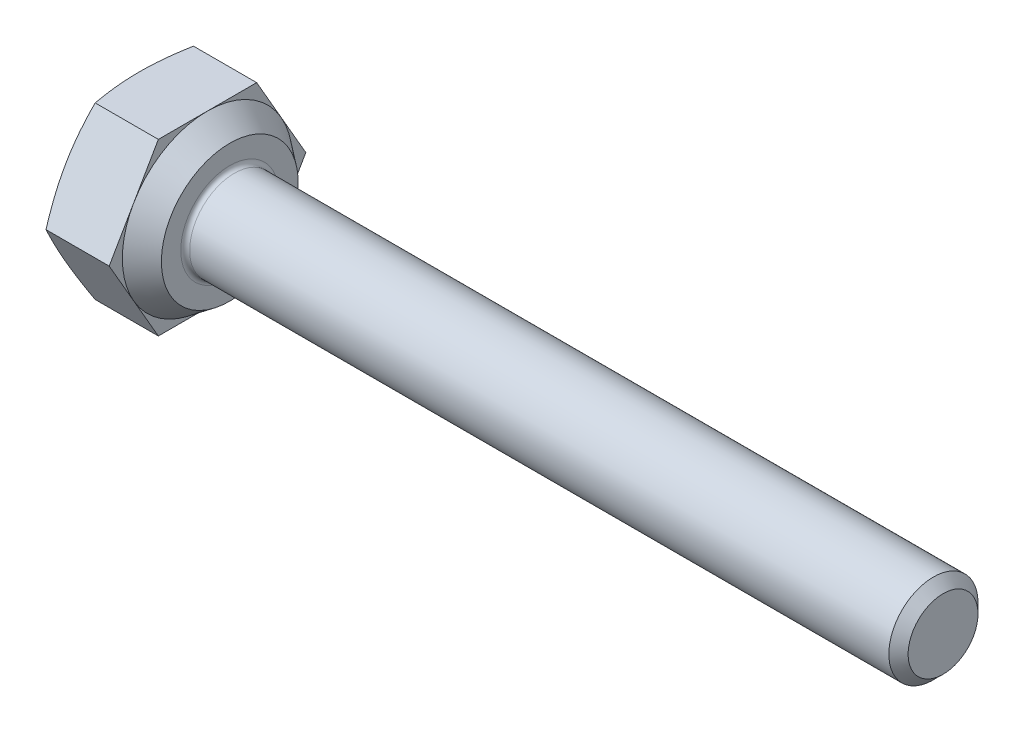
ISO-10303-21;
HEADER;
FILE_DESCRIPTION(('STEP AP214'),'2;1');
FILE_NAME('part.step','',(''),(''),'','','');
FILE_SCHEMA(('AUTOMOTIVE_DESIGN { 1 0 10303 214 1 1 1 1 }'));
ENDSEC;
DATA;
#1=APPLICATION_CONTEXT('core data for automotive mechanical design processes');
#2=APPLICATION_PROTOCOL_DEFINITION('international standard','automotive_design',2000,#1);
#3=PRODUCT_CONTEXT('',#1,'mechanical');
#4=PRODUCT('Part','Part','',(#3));
#5=PRODUCT_RELATED_PRODUCT_CATEGORY('part','',(#4));
#6=PRODUCT_DEFINITION_FORMATION('','',#4);
#7=PRODUCT_DEFINITION_CONTEXT('part definition',#1,'design');
#8=PRODUCT_DEFINITION('design','',#6,#7);
#9=PRODUCT_DEFINITION_SHAPE('','',#8);
#10=(LENGTH_UNIT() NAMED_UNIT(*) SI_UNIT(.MILLI.,.METRE.));
#11=(NAMED_UNIT(*) PLANE_ANGLE_UNIT() SI_UNIT($,.RADIAN.));
#12=(NAMED_UNIT(*) SI_UNIT($,.STERADIAN.) SOLID_ANGLE_UNIT());
#13=UNCERTAINTY_MEASURE_WITH_UNIT(LENGTH_MEASURE(1.E-05),#10,'distance_accuracy_value','');
#14=(GEOMETRIC_REPRESENTATION_CONTEXT(3) GLOBAL_UNCERTAINTY_ASSIGNED_CONTEXT((#13)) GLOBAL_UNIT_ASSIGNED_CONTEXT((#10,
#11,#12)) REPRESENTATION_CONTEXT('',''));
#15=CARTESIAN_POINT('',(0.,0.,0.));
#16=DIRECTION('',(0.,0.,1.));
#17=DIRECTION('',(1.,0.,0.));
#18=AXIS2_PLACEMENT_3D('',#15,#16,#17);
#19=CARTESIAN_POINT('',(2.025,0.,0.));
#20=DIRECTION('',(1.,0.,0.));
#21=DIRECTION('',(0.,0.,-1.));
#22=AXIS2_PLACEMENT_3D('',#19,#20,#21);
#23=PLANE('',#22);
#24=CARTESIAN_POINT('',(2.025,0.,0.));
#25=DIRECTION('',(1.,0.,0.));
#26=DIRECTION('',(0.,0.,-1.));
#27=AXIS2_PLACEMENT_3D('',#24,#25,#26);
#28=CIRCLE('',#27,1.1);
#29=CARTESIAN_POINT('',(2.025,0.,-1.1));
#30=VERTEX_POINT('',#29);
#31=EDGE_CURVE('E188',#30,#30,#28,.F.);
#32=ORIENTED_EDGE('',*,*,#31,.T.);
#33=EDGE_LOOP('',(#32));
#34=FACE_BOUND('',#33,.T.);
#35=CARTESIAN_POINT('',(2.025,0.,0.));
#36=DIRECTION('',(-1.,0.,0.));
#37=DIRECTION('',(0.,0.,1.));
#38=AXIS2_PLACEMENT_3D('',#35,#36,#37);
#39=CIRCLE('',#38,1.535);
#40=CARTESIAN_POINT('',(2.025,0.,1.535));
#41=VERTEX_POINT('',#40);
#42=EDGE_CURVE('E138',#41,#41,#39,.T.);
#43=ORIENTED_EDGE('',*,*,#42,.F.);
#44=EDGE_LOOP('',(#43));
#45=FACE_BOUND('',#44,.T.);
#46=ADVANCED_FACE('F33',(#34,#45),#23,.T.);
#47=CARTESIAN_POINT('',(1.525,-3.82,0.));
#48=DIRECTION('',(-1.,0.,0.));
#49=DIRECTION('',(0.,0.,1.));
#50=AXIS2_PLACEMENT_3D('',#47,#48,#49);
#51=PLANE('',#50);
#52=DIRECTION('',(0.,-0.866025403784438,0.5));
#53=VECTOR('',#52,1.);
#54=CARTESIAN_POINT('',(1.525,1.91,1.10273901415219));
#55=LINE('',#54,#53);
#56=CARTESIAN_POINT('',(1.525,1.91,1.10273901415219));
#57=VERTEX_POINT('',#56);
#58=CARTESIAN_POINT('',(1.525,0.955000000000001,1.65410852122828));
#59=VERTEX_POINT('',#58);
#60=EDGE_CURVE('E137',#57,#59,#55,.T.);
#61=ORIENTED_EDGE('',*,*,#60,.T.);
#62=CARTESIAN_POINT('',(1.525,0.,0.));
#63=DIRECTION('',(-1.,0.,0.));
#64=DIRECTION('',(0.,0.,1.));
#65=AXIS2_PLACEMENT_3D('',#62,#63,#64);
#66=CIRCLE('',#65,1.91);
#67=CARTESIAN_POINT('',(1.525,1.91,0.));
#68=VERTEX_POINT('',#67);
#69=EDGE_CURVE('E49',#59,#68,#66,.T.);
#70=ORIENTED_EDGE('',*,*,#69,.T.);
#71=DIRECTION('',(0.,0.,1.));
#72=VECTOR('',#71,1.);
#73=CARTESIAN_POINT('',(1.525,1.91,-1.10273901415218));
#74=LINE('',#73,#72);
#75=EDGE_CURVE('E134',#68,#57,#74,.T.);
#76=ORIENTED_EDGE('',*,*,#75,.T.);
#77=EDGE_LOOP('',(#61,#70,#76));
#78=FACE_BOUND('',#77,.T.);
#79=ADVANCED_FACE('F133',(#78),#51,.F.);
#80=CARTESIAN_POINT('',(1.525,1.91,-1.10273901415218));
#81=VERTEX_POINT('',#80);
#82=EDGE_CURVE('E145',#81,#68,#74,.T.);
#83=ORIENTED_EDGE('',*,*,#82,.T.);
#84=CARTESIAN_POINT('',(1.525,0.955,-1.65410852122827));
#85=VERTEX_POINT('',#84);
#86=EDGE_CURVE('E121',#68,#85,#66,.T.);
#87=ORIENTED_EDGE('',*,*,#86,.T.);
#88=DIRECTION('',(0.,0.866025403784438,0.5));
#89=VECTOR('',#88,1.);
#90=CARTESIAN_POINT('',(1.525,0.,-2.20547802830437));
#91=LINE('',#90,#89);
#92=EDGE_CURVE('E151',#85,#81,#91,.T.);
#93=ORIENTED_EDGE('',*,*,#92,.T.);
#94=EDGE_LOOP('',(#83,#87,#93));
#95=FACE_BOUND('',#94,.T.);
#96=ADVANCED_FACE('F150',(#95),#51,.F.);
#97=CARTESIAN_POINT('',(1.525,0.,-2.20547802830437));
#98=VERTEX_POINT('',#97);
#99=EDGE_CURVE('E148',#98,#85,#91,.T.);
#100=ORIENTED_EDGE('',*,*,#99,.T.);
#101=CARTESIAN_POINT('',(1.525,-0.954999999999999,-1.65410852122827));
#102=VERTEX_POINT('',#101);
#103=EDGE_CURVE('E124',#85,#102,#66,.T.);
#104=ORIENTED_EDGE('',*,*,#103,.T.);
#105=DIRECTION('',(0.,0.866025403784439,-0.5));
#106=VECTOR('',#105,1.);
#107=CARTESIAN_POINT('',(1.525,-1.91,-1.10273901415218));
#108=LINE('',#107,#106);
#109=EDGE_CURVE('E348',#102,#98,#108,.T.);
#110=ORIENTED_EDGE('',*,*,#109,.T.);
#111=EDGE_LOOP('',(#100,#104,#110));
#112=FACE_BOUND('',#111,.T.);
#113=ADVANCED_FACE('F302',(#112),#51,.F.);
#114=CARTESIAN_POINT('',(1.525,-1.91,-1.10273901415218));
#115=VERTEX_POINT('',#114);
#116=EDGE_CURVE('E316',#115,#102,#108,.T.);
#117=ORIENTED_EDGE('',*,*,#116,.T.);
#118=CARTESIAN_POINT('',(1.525,-1.91,0.));
#119=VERTEX_POINT('',#118);
#120=EDGE_CURVE('E317',#102,#119,#66,.T.);
#121=ORIENTED_EDGE('',*,*,#120,.T.);
#122=DIRECTION('',(0.,0.,-1.));
#123=VECTOR('',#122,1.);
#124=CARTESIAN_POINT('',(1.525,-1.91,1.10273901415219));
#125=LINE('',#124,#123);
#126=EDGE_CURVE('E162',#119,#115,#125,.T.);
#127=ORIENTED_EDGE('',*,*,#126,.T.);
#128=EDGE_LOOP('',(#117,#121,#127));
#129=FACE_BOUND('',#128,.T.);
#130=ADVANCED_FACE('F295',(#129),#51,.F.);
#131=CARTESIAN_POINT('',(1.525,-1.91,1.10273901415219));
#132=VERTEX_POINT('',#131);
#133=EDGE_CURVE('E163',#132,#119,#125,.T.);
#134=ORIENTED_EDGE('',*,*,#133,.T.);
#135=CARTESIAN_POINT('',(1.525,-0.955,1.65410852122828));
#136=VERTEX_POINT('',#135);
#137=EDGE_CURVE('E306',#119,#136,#66,.T.);
#138=ORIENTED_EDGE('',*,*,#137,.T.);
#139=DIRECTION('',(0.,-0.866025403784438,-0.5));
#140=VECTOR('',#139,1.);
#141=CARTESIAN_POINT('',(1.525,0.,2.20547802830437));
#142=LINE('',#141,#140);
#143=EDGE_CURVE('E158',#136,#132,#142,.T.);
#144=ORIENTED_EDGE('',*,*,#143,.T.);
#145=EDGE_LOOP('',(#134,#138,#144));
#146=FACE_BOUND('',#145,.T.);
#147=ADVANCED_FACE('F287',(#146),#51,.F.);
#148=CARTESIAN_POINT('',(1.525,-1.91,-1.10273901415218));
#149=DIRECTION('',(0.,0.5,0.866025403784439));
#150=DIRECTION('',(0.,-0.866025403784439,0.5));
#151=AXIS2_PLACEMENT_3D('',#148,#149,#150);
#152=PLANE('',#151);
#153=CARTESIAN_POINT('',(0.107587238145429,0.000199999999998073,-2.20559349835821));
#154=CARTESIAN_POINT('',(0.0909543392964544,-0.0789137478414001,-2.15991715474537));
#155=CARTESIAN_POINT('',(0.0758236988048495,-0.158288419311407,-2.11409016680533));
#156=CARTESIAN_POINT('',(0.0492035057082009,-0.317553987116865,-2.02213814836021));
#157=CARTESIAN_POINT('',(0.037716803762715,-0.397445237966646,-1.97601291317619));
#158=CARTESIAN_POINT('',(0.019137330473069,-0.556857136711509,-1.88397641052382));
#159=CARTESIAN_POINT('',(0.0120040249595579,-0.636374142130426,-1.83806724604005));
#160=CARTESIAN_POINT('',(0.00243624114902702,-0.795594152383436,-1.7461415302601));
#161=CARTESIAN_POINT('',(0.,-0.875297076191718,-1.70012502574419));
#162=CARTESIAN_POINT('',(0.,-1.03470292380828,-1.60809201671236));
#163=CARTESIAN_POINT('',(0.00243624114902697,-1.11440584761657,-1.56207551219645));
#164=CARTESIAN_POINT('',(0.0120040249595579,-1.27362585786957,-1.4701497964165));
#165=CARTESIAN_POINT('',(0.019137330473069,-1.35314286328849,-1.42424063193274));
#166=CARTESIAN_POINT('',(0.037716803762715,-1.51255476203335,-1.33220412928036));
#167=CARTESIAN_POINT('',(0.0492035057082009,-1.59244601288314,-1.28607889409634));
#168=CARTESIAN_POINT('',(0.0758236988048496,-1.75171158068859,-1.19412687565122));
#169=CARTESIAN_POINT('',(0.0909543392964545,-1.8310862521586,-1.14829988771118));
#170=CARTESIAN_POINT('',(0.10758723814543,-1.9102,-1.10262354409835));
#171=B_SPLINE_CURVE_WITH_KNOTS('',3,(#153,#154,#155,#156,#157,#158,#159,#160,#161,#162,#163,
#164,#165,#166,#167,#168,#169,#170),.UNSPECIFIED.,.F.,.F.,(4,2,2,2,2,2,2,2,4),(0.,
0.278592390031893,0.557402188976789,0.833574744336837,1.10964362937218,1.38571251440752,
1.66188506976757,1.94069486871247,2.21928725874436),.UNSPECIFIED.);
#172=CARTESIAN_POINT('',(0.107545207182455,0.,-2.20547802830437));
#173=VERTEX_POINT('',#172);
#174=CARTESIAN_POINT('',(0.,-0.955000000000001,-1.65410852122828));
#175=VERTEX_POINT('',#174);
#176=EDGE_CURVE('E332',#173,#175,#171,.T.);
#177=ORIENTED_EDGE('',*,*,#176,.F.);
#178=DIRECTION('',(-1.,0.,0.));
#179=VECTOR('',#178,1.);
#180=CARTESIAN_POINT('',(1.525,0.,-2.20547802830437));
#181=LINE('',#180,#179);
#182=EDGE_CURVE('E178',#98,#173,#181,.T.);
#183=ORIENTED_EDGE('',*,*,#182,.F.);
#184=ORIENTED_EDGE('',*,*,#109,.F.);
#185=ORIENTED_EDGE('',*,*,#116,.F.);
#186=DIRECTION('',(-1.,0.,0.));
#187=VECTOR('',#186,1.);
#188=CARTESIAN_POINT('',(1.525,-1.91,-1.10273901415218));
#189=LINE('',#188,#187);
#190=CARTESIAN_POINT('',(0.107545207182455,-1.91,-1.10273901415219));
#191=VERTEX_POINT('',#190);
#192=EDGE_CURVE('E166',#115,#191,#189,.T.);
#193=ORIENTED_EDGE('',*,*,#192,.T.);
#194=EDGE_CURVE('E245',#175,#191,#171,.T.);
#195=ORIENTED_EDGE('',*,*,#194,.F.);
#196=EDGE_LOOP('',(#177,#183,#184,#185,#193,#195));
#197=FACE_BOUND('',#196,.T.);
#198=ADVANCED_FACE('F35',(#197),#152,.F.);
#199=CARTESIAN_POINT('',(1.525,0.,-2.20547802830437));
#200=DIRECTION('',(0.,-0.5,0.866025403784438));
#201=DIRECTION('',(0.,-0.866025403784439,-0.5));
#202=AXIS2_PLACEMENT_3D('',#199,#200,#201);
#203=PLANE('',#202);
#204=CARTESIAN_POINT('',(0.10758723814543,1.9102,-1.10262354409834));
#205=CARTESIAN_POINT('',(0.0909543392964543,1.8310862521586,-1.14829988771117));
#206=CARTESIAN_POINT('',(0.0758236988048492,1.7517115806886,-1.19412687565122));
#207=CARTESIAN_POINT('',(0.0492035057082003,1.59244601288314,-1.28607889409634));
#208=CARTESIAN_POINT('',(0.0377168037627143,1.51255476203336,-1.33220412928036));
#209=CARTESIAN_POINT('',(0.0191373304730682,1.35314286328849,-1.42424063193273));
#210=CARTESIAN_POINT('',(0.0120040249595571,1.27362585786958,-1.4701497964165));
#211=CARTESIAN_POINT('',(0.00243624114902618,1.11440584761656,-1.56207551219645));
#212=CARTESIAN_POINT('',(0.,1.03470292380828,-1.60809201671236));
#213=CARTESIAN_POINT('',(0.,0.875297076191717,-1.70012502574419));
#214=CARTESIAN_POINT('',(0.00243624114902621,0.795594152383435,-1.7461415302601));
#215=CARTESIAN_POINT('',(0.0120040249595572,0.636374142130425,-1.83806724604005));
#216=CARTESIAN_POINT('',(0.0191373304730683,0.556857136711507,-1.88397641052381));
#217=CARTESIAN_POINT('',(0.0377168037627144,0.397445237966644,-1.97601291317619));
#218=CARTESIAN_POINT('',(0.0492035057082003,0.317553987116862,-2.02213814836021));
#219=CARTESIAN_POINT('',(0.0758236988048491,0.158288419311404,-2.11409016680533));
#220=CARTESIAN_POINT('',(0.0909543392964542,0.0789137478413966,-2.15991715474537));
#221=CARTESIAN_POINT('',(0.107587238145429,-0.000200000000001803,-2.20559349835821));
#222=B_SPLINE_CURVE_WITH_KNOTS('',3,(#204,#205,#206,#207,#208,#209,#210,#211,#212,#213,#214,
#215,#216,#217,#218,#219,#220,#221),.UNSPECIFIED.,.F.,.F.,(4,2,2,2,2,2,2,2,4),(0.,
0.278592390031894,0.557402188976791,0.83357474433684,1.10964362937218,1.38571251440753,
1.66188506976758,1.94069486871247,2.21928725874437),.UNSPECIFIED.);
#223=CARTESIAN_POINT('',(0.107545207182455,1.91,-1.10273901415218));
#224=VERTEX_POINT('',#223);
#225=CARTESIAN_POINT('',(0.,0.955000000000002,-1.65410852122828));
#226=VERTEX_POINT('',#225);
#227=EDGE_CURVE('E260',#224,#226,#222,.T.);
#228=ORIENTED_EDGE('',*,*,#227,.F.);
#229=DIRECTION('',(-1.,0.,0.));
#230=VECTOR('',#229,1.);
#231=CARTESIAN_POINT('',(1.525,1.91,-1.10273901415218));
#232=LINE('',#231,#230);
#233=EDGE_CURVE('E176',#81,#224,#232,.T.);
#234=ORIENTED_EDGE('',*,*,#233,.F.);
#235=ORIENTED_EDGE('',*,*,#92,.F.);
#236=ORIENTED_EDGE('',*,*,#99,.F.);
#237=ORIENTED_EDGE('',*,*,#182,.T.);
#238=EDGE_CURVE('E256',#226,#173,#222,.T.);
#239=ORIENTED_EDGE('',*,*,#238,.F.);
#240=EDGE_LOOP('',(#228,#234,#235,#236,#237,#239));
#241=FACE_BOUND('',#240,.T.);
#242=ADVANCED_FACE('F266',(#241),#203,.F.);
#243=CARTESIAN_POINT('',(1.525,1.91,-1.10273901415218));
#244=DIRECTION('',(0.,-1.,0.));
#245=DIRECTION('',(0.,0.,-1.));
#246=AXIS2_PLACEMENT_3D('',#243,#244,#245);
#247=PLANE('',#246);
#248=CARTESIAN_POINT('',(0.574679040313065,1.91,-2.91966549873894));
#249=CARTESIAN_POINT('',(0.54836527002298,1.91,-2.83325008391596));
#250=CARTESIAN_POINT('',(0.52235904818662,1.91,-2.74673957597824));
#251=CARTESIAN_POINT('',(0.471130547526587,1.91,-2.57347961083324));
#252=CARTESIAN_POINT('',(0.445908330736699,1.91,-2.48673013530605));
#253=CARTESIAN_POINT('',(0.396374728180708,1.91,-2.31279499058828));
#254=CARTESIAN_POINT('',(0.372065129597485,1.91,-2.22560880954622));
#255=CARTESIAN_POINT('',(0.324646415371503,1.91,-2.05091324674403));
#256=CARTESIAN_POINT('',(0.30153727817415,1.91,-1.9634038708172));
#257=CARTESIAN_POINT('',(0.234979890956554,1.91,-1.70246638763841));
#258=CARTESIAN_POINT('',(0.193675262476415,1.91,-1.52847713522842));
#259=CARTESIAN_POINT('',(0.12005286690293,1.91,-1.178616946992));
#260=CARTESIAN_POINT('',(0.0877313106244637,1.91,-1.00274683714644));
#261=CARTESIAN_POINT('',(0.0395314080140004,1.91,-0.668773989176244));
#262=CARTESIAN_POINT('',(0.0222150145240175,1.91,-0.510891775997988));
#263=CARTESIAN_POINT('',(0.00651234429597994,1.91,-0.27345261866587));
#264=CARTESIAN_POINT('',(0.00298967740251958,1.91,-0.194224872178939));
#265=CARTESIAN_POINT('',(-0.000473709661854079,1.91,-0.0356876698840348));
#266=CARTESIAN_POINT('',(-0.000414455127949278,1.91,0.0436217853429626));
#267=CARTESIAN_POINT('',(0.0032985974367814,1.91,0.202555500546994));
#268=CARTESIAN_POINT('',(0.00697055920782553,1.91,0.282179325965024));
#269=CARTESIAN_POINT('',(0.0177385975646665,1.91,0.441196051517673));
#270=CARTESIAN_POINT('',(0.0248348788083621,1.91,0.520588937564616));
#271=CARTESIAN_POINT('',(0.0421192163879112,1.91,0.679100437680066));
#272=CARTESIAN_POINT('',(0.0523098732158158,1.91,0.758218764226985));
#273=CARTESIAN_POINT('',(0.0753722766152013,1.91,0.916058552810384));
#274=CARTESIAN_POINT('',(0.0882440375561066,1.91,0.994780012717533));
#275=CARTESIAN_POINT('',(0.131716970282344,1.91,1.23864108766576));
#276=CARTESIAN_POINT('',(0.166184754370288,1.91,1.40308945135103));
#277=CARTESIAN_POINT('',(0.241753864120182,1.91,1.73045898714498));
#278=CARTESIAN_POINT('',(0.282857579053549,1.91,1.89337958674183));
#279=CARTESIAN_POINT('',(0.369487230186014,1.91,2.21825522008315));
#280=CARTESIAN_POINT('',(0.415018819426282,1.91,2.38020873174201));
#281=CARTESIAN_POINT('',(0.509011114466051,1.91,2.70322702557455));
#282=CARTESIAN_POINT('',(0.557471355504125,1.91,2.86429194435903));
#283=CARTESIAN_POINT('',(0.655872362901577,1.91,3.18402082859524));
#284=CARTESIAN_POINT('',(0.705790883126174,1.91,3.34269167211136));
#285=CARTESIAN_POINT('',(0.807045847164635,1.91,3.65958717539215));
#286=CARTESIAN_POINT('',(0.858382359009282,1.91,3.81781181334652));
#287=CARTESIAN_POINT('',(0.961892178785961,1.91,4.13332143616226));
#288=CARTESIAN_POINT('',(1.01406157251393,1.91,4.29060770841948));
#289=CARTESIAN_POINT('',(1.11918255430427,1.91,4.60490446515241));
#290=CARTESIAN_POINT('',(1.17213407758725,1.91,4.76191497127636));
#291=CARTESIAN_POINT('',(1.22535923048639,1.91,4.91883132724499));
#292=B_SPLINE_CURVE_WITH_KNOTS('',3,(#248,#249,#250,#251,#252,#253,#254,#255,#256,#257,#258,
#259,#260,#261,#262,#263,#264,#265,#266,#267,#268,#269,#270,#271,#272,#273,#274,#275,#276,#277,
#278,#279,#280,#281,#282,#283,#284,#285,#286,#287,#288,#289,#290,#291),.UNSPECIFIED.,.F.,.F.,(4,
2,2,2,2,2,2,2,2,2,2,2,2,2,2,2,2,2,2,2,2,4),(0.,0.271000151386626,0.542021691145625,
0.813548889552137,1.08507121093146,1.62139513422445,2.15749248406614,2.63343913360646,
2.87128522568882,3.10912963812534,3.34817601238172,3.58723667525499,3.82649880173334,
4.06576221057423,4.56958221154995,5.07358401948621,5.57823794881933,6.08281200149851,
6.58181660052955,7.08084518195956,7.57798027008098,8.07507441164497),.UNSPECIFIED.);
#293=CARTESIAN_POINT('',(0.107545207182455,1.91,1.10273901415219));
#294=VERTEX_POINT('',#293);
#295=CARTESIAN_POINT('',(0.,1.91,0.));
#296=VERTEX_POINT('',#295);
#297=EDGE_CURVE('E349',#294,#296,#292,.F.);
#298=ORIENTED_EDGE('',*,*,#297,.F.);
#299=DIRECTION('',(-1.,0.,0.));
#300=VECTOR('',#299,1.);
#301=CARTESIAN_POINT('',(1.525,1.91,1.10273901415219));
#302=LINE('',#301,#300);
#303=EDGE_CURVE('E147',#57,#294,#302,.T.);
#304=ORIENTED_EDGE('',*,*,#303,.F.);
#305=ORIENTED_EDGE('',*,*,#75,.F.);
#306=ORIENTED_EDGE('',*,*,#82,.F.);
#307=ORIENTED_EDGE('',*,*,#233,.T.);
#308=EDGE_CURVE('E261',#296,#224,#292,.F.);
#309=ORIENTED_EDGE('',*,*,#308,.F.);
#310=EDGE_LOOP('',(#298,#304,#305,#306,#307,#309));
#311=FACE_BOUND('',#310,.T.);
#312=ADVANCED_FACE('F143',(#311),#247,.F.);
#313=CARTESIAN_POINT('',(1.525,1.91,1.10273901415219));
#314=DIRECTION('',(0.,-0.5,-0.866025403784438));
#315=DIRECTION('',(0.,0.866025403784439,-0.5));
#316=AXIS2_PLACEMENT_3D('',#313,#314,#315);
#317=PLANE('',#316);
#318=CARTESIAN_POINT('',(0.107587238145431,-0.00019999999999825,2.20559349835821));
#319=CARTESIAN_POINT('',(0.0909543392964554,0.0789137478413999,2.15991715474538));
#320=CARTESIAN_POINT('',(0.0758236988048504,0.158288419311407,2.11409016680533));
#321=CARTESIAN_POINT('',(0.0492035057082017,0.317553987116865,2.02213814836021));
#322=CARTESIAN_POINT('',(0.0377168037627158,0.397445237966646,1.9760129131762));
#323=CARTESIAN_POINT('',(0.0191373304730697,0.556857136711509,1.88397641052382));
#324=CARTESIAN_POINT('',(0.0120040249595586,0.636374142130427,1.83806724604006));
#325=CARTESIAN_POINT('',(0.00243624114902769,0.795594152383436,1.74614153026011));
#326=CARTESIAN_POINT('',(0.,0.875297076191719,1.70012502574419));
#327=CARTESIAN_POINT('',(0.,1.03470292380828,1.60809201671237));
#328=CARTESIAN_POINT('',(0.00243624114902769,1.11440584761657,1.56207551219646));
#329=CARTESIAN_POINT('',(0.0120040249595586,1.27362585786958,1.47014979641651));
#330=CARTESIAN_POINT('',(0.0191373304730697,1.35314286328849,1.42424063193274));
#331=CARTESIAN_POINT('',(0.0377168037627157,1.51255476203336,1.33220412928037));
#332=CARTESIAN_POINT('',(0.0492035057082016,1.59244601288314,1.28607889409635));
#333=CARTESIAN_POINT('',(0.0758236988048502,1.7517115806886,1.19412687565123));
#334=CARTESIAN_POINT('',(0.0909543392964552,1.8310862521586,1.14829988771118));
#335=CARTESIAN_POINT('',(0.10758723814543,1.9102,1.10262354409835));
#336=B_SPLINE_CURVE_WITH_KNOTS('',3,(#318,#319,#320,#321,#322,#323,#324,#325,#326,#327,#328,
#329,#330,#331,#332,#333,#334,#335),.UNSPECIFIED.,.F.,.F.,(4,2,2,2,2,2,2,2,4),(0.,
0.278592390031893,0.55740218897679,0.833574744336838,1.10964362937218,1.38571251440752,
1.66188506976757,1.94069486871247,2.21928725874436),.UNSPECIFIED.);
#337=CARTESIAN_POINT('',(0.107545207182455,0.,2.20547802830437));
#338=VERTEX_POINT('',#337);
#339=CARTESIAN_POINT('',(0.,0.955000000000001,1.65410852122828));
#340=VERTEX_POINT('',#339);
#341=EDGE_CURVE('E250',#338,#340,#336,.T.);
#342=ORIENTED_EDGE('',*,*,#341,.F.);
#343=DIRECTION('',(-1.,0.,0.));
#344=VECTOR('',#343,1.);
#345=CARTESIAN_POINT('',(1.525,0.,2.20547802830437));
#346=LINE('',#345,#344);
#347=CARTESIAN_POINT('',(1.525,0.,2.20547802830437));
#348=VERTEX_POINT('',#347);
#349=EDGE_CURVE('E172',#348,#338,#346,.T.);
#350=ORIENTED_EDGE('',*,*,#349,.F.);
#351=EDGE_CURVE('E153',#59,#348,#55,.T.);
#352=ORIENTED_EDGE('',*,*,#351,.F.);
#353=ORIENTED_EDGE('',*,*,#60,.F.);
#354=ORIENTED_EDGE('',*,*,#303,.T.);
#355=EDGE_CURVE('E335',#340,#294,#336,.T.);
#356=ORIENTED_EDGE('',*,*,#355,.F.);
#357=EDGE_LOOP('',(#342,#350,#352,#353,#354,#356));
#358=FACE_BOUND('',#357,.T.);
#359=ADVANCED_FACE('F272',(#358),#317,.F.);
#360=CARTESIAN_POINT('',(1.525,0.,2.20547802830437));
#361=DIRECTION('',(0.,0.5,-0.866025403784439));
#362=DIRECTION('',(0.,0.866025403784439,0.5));
#363=AXIS2_PLACEMENT_3D('',#360,#361,#362);
#364=PLANE('',#363);
#365=CARTESIAN_POINT('',(0.10758723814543,-1.9102,1.10262354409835));
#366=CARTESIAN_POINT('',(0.0909543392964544,-1.8310862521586,1.14829988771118));
#367=CARTESIAN_POINT('',(0.0758236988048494,-1.75171158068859,1.19412687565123));
#368=CARTESIAN_POINT('',(0.0492035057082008,-1.59244601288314,1.28607889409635));
#369=CARTESIAN_POINT('',(0.0377168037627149,-1.51255476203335,1.33220412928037));
#370=CARTESIAN_POINT('',(0.0191373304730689,-1.35314286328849,1.42424063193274));
#371=CARTESIAN_POINT('',(0.0120040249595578,-1.27362585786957,1.47014979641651));
#372=CARTESIAN_POINT('',(0.00243624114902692,-1.11440584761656,1.56207551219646));
#373=CARTESIAN_POINT('',(0.,-1.03470292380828,1.60809201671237));
#374=CARTESIAN_POINT('',(0.,-0.875297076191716,1.70012502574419));
#375=CARTESIAN_POINT('',(0.00243624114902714,-0.795594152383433,1.74614153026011));
#376=CARTESIAN_POINT('',(0.0120040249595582,-0.636374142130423,1.83806724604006));
#377=CARTESIAN_POINT('',(0.0191373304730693,-0.556857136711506,1.88397641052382));
#378=CARTESIAN_POINT('',(0.0377168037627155,-0.397445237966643,1.9760129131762));
#379=CARTESIAN_POINT('',(0.0492035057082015,-0.317553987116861,2.02213814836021));
#380=CARTESIAN_POINT('',(0.0758236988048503,-0.158288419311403,2.11409016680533));
#381=CARTESIAN_POINT('',(0.0909543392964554,-0.0789137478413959,2.15991715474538));
#382=CARTESIAN_POINT('',(0.107587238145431,0.000200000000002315,2.20559349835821));
#383=B_SPLINE_CURVE_WITH_KNOTS('',3,(#365,#366,#367,#368,#369,#370,#371,#372,#373,#374,#375,
#376,#377,#378,#379,#380,#381,#382),.UNSPECIFIED.,.F.,.F.,(4,2,2,2,2,2,2,2,4),(0.,
0.278592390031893,0.55740218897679,0.833574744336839,1.10964362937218,1.38571251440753,
1.66188506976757,1.94069486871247,2.21928725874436),.UNSPECIFIED.);
#384=CARTESIAN_POINT('',(0.107545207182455,-1.91,1.10273901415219));
#385=VERTEX_POINT('',#384);
#386=CARTESIAN_POINT('',(0.,-0.955000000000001,1.65410852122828));
#387=VERTEX_POINT('',#386);
#388=EDGE_CURVE('E238',#385,#387,#383,.T.);
#389=ORIENTED_EDGE('',*,*,#388,.F.);
#390=DIRECTION('',(-1.,0.,0.));
#391=VECTOR('',#390,1.);
#392=CARTESIAN_POINT('',(1.525,-1.91,1.10273901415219));
#393=LINE('',#392,#391);
#394=EDGE_CURVE('E169',#132,#385,#393,.T.);
#395=ORIENTED_EDGE('',*,*,#394,.F.);
#396=ORIENTED_EDGE('',*,*,#143,.F.);
#397=EDGE_CURVE('E159',#348,#136,#142,.T.);
#398=ORIENTED_EDGE('',*,*,#397,.F.);
#399=ORIENTED_EDGE('',*,*,#349,.T.);
#400=EDGE_CURVE('E330',#387,#338,#383,.T.);
#401=ORIENTED_EDGE('',*,*,#400,.F.);
#402=EDGE_LOOP('',(#389,#395,#396,#398,#399,#401));
#403=FACE_BOUND('',#402,.T.);
#404=ADVANCED_FACE('F275',(#403),#364,.F.);
#405=CARTESIAN_POINT('',(1.525,-1.91,1.10273901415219));
#406=DIRECTION('',(0.,1.,0.));
#407=DIRECTION('',(0.,0.,1.));
#408=AXIS2_PLACEMENT_3D('',#405,#406,#407);
#409=PLANE('',#408);
#410=CARTESIAN_POINT('',(0.574678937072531,-1.91,-2.91966515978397));
#411=CARTESIAN_POINT('',(0.548365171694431,-1.91,-2.8332497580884));
#412=CARTESIAN_POINT('',(0.522358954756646,-1.91,-2.74673926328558));
#413=CARTESIAN_POINT('',(0.471130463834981,-1.91,-2.57347932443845));
#414=CARTESIAN_POINT('',(0.445908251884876,-1.91,-2.48672986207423));
#415=CARTESIAN_POINT('',(0.396374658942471,-1.91,-2.31279474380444));
#416=CARTESIAN_POINT('',(0.372065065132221,-1.91,-2.22560857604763));
#417=CARTESIAN_POINT('',(0.324646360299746,-1.91,-2.0509130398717));
#418=CARTESIAN_POINT('',(0.301537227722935,-1.91,-1.96340367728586));
#419=CARTESIAN_POINT('',(0.234979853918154,-1.91,-1.70246623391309));
#420=CARTESIAN_POINT('',(0.193675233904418,-1.91,-1.52847700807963));
#421=CARTESIAN_POINT('',(0.120052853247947,-1.91,-1.17861687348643));
#422=CARTESIAN_POINT('',(0.0877313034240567,-1.91,-1.00274679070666));
#423=CARTESIAN_POINT('',(0.0395314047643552,-1.91,-0.668773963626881));
#424=CARTESIAN_POINT('',(0.0222150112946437,-1.91,-0.510891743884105));
#425=CARTESIAN_POINT('',(0.00651234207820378,-1.91,-0.273452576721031));
#426=CARTESIAN_POINT('',(0.0029896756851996,-1.91,-0.194224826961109));
#427=CARTESIAN_POINT('',(-0.000473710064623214,-1.91,-0.0356876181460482));
#428=CARTESIAN_POINT('',(-0.000414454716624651,-1.91,0.0436218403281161));
#429=CARTESIAN_POINT('',(0.00329859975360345,-1.91,0.202555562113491));
#430=CARTESIAN_POINT('',(0.00697056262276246,-1.91,0.282179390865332));
#431=CARTESIAN_POINT('',(0.0177386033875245,-1.91,0.44119612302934));
#432=CARTESIAN_POINT('',(0.024834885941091,-1.91,0.520589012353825));
#433=CARTESIAN_POINT('',(0.0421192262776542,-1.91,0.679100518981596));
#434=CARTESIAN_POINT('',(0.0523098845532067,-1.91,0.758218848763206));
#435=CARTESIAN_POINT('',(0.0753722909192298,-1.91,0.916058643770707));
#436=CARTESIAN_POINT('',(0.0882440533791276,-1.91,0.994780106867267));
#437=CARTESIAN_POINT('',(0.131716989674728,-1.91,1.23864118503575));
#438=CARTESIAN_POINT('',(0.166184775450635,-1.91,1.4030895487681));
#439=CARTESIAN_POINT('',(0.241753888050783,-1.91,1.73045908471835));
#440=CARTESIAN_POINT('',(0.282857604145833,-1.91,1.89337968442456));
#441=CARTESIAN_POINT('',(0.369487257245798,-1.91,2.21825531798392));
#442=CARTESIAN_POINT('',(0.415018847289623,-1.91,2.38020882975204));
#443=CARTESIAN_POINT('',(0.50901114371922,-1.91,2.70322712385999));
#444=CARTESIAN_POINT('',(0.557471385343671,-1.91,2.86429204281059));
#445=CARTESIAN_POINT('',(0.655872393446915,-1.91,3.18402092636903));
#446=CARTESIAN_POINT('',(0.70579091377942,-1.91,3.34269176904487));
#447=CARTESIAN_POINT('',(0.807045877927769,-1.91,3.65958727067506));
#448=CARTESIAN_POINT('',(0.85838238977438,-1.91,3.81781190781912));
#449=CARTESIAN_POINT('',(0.961892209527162,-1.91,4.13332152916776));
#450=CARTESIAN_POINT('',(1.01406160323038,-1.91,4.29060780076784));
#451=CARTESIAN_POINT('',(1.11918258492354,-1.91,4.60490455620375));
#452=CARTESIAN_POINT('',(1.1721341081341,-1.91,4.76191506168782));
#453=CARTESIAN_POINT('',(1.22535926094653,-1.91,4.91883141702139));
#454=B_SPLINE_CURVE_WITH_KNOTS('',3,(#410,#411,#412,#413,#414,#415,#416,#417,#418,#419,#420,
#421,#422,#423,#424,#425,#426,#427,#428,#429,#430,#431,#432,#433,#434,#435,#436,#437,#438,#439,
#440,#441,#442,#443,#444,#445,#446,#447,#448,#449,#450,#451,#452,#453),.UNSPECIFIED.,.F.,.F.,(4,
2,2,2,2,2,2,2,2,2,2,2,2,2,2,2,2,2,2,2,2,4),(0.,0.271000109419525,0.542021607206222,
0.81354876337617,1.08507104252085,1.62139488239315,2.15749214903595,2.63343881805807,
2.87128491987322,3.10912934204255,3.3481757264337,3.58723639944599,3.82649853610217,
4.06576195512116,4.56958195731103,5.07358376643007,5.57823769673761,6.08281175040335,
6.58181634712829,7.08084492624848,7.57798001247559,8.07507415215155),.UNSPECIFIED.);
#455=CARTESIAN_POINT('',(0.,-1.91,0.));
#456=VERTEX_POINT('',#455);
#457=EDGE_CURVE('E323',#191,#456,#454,.T.);
#458=ORIENTED_EDGE('',*,*,#457,.F.);
#459=ORIENTED_EDGE('',*,*,#192,.F.);
#460=ORIENTED_EDGE('',*,*,#126,.F.);
#461=ORIENTED_EDGE('',*,*,#133,.F.);
#462=ORIENTED_EDGE('',*,*,#394,.T.);
#463=EDGE_CURVE('E228',#456,#385,#454,.T.);
#464=ORIENTED_EDGE('',*,*,#463,.F.);
#465=EDGE_LOOP('',(#458,#459,#460,#461,#462,#464));
#466=FACE_BOUND('',#465,.T.);
#467=ADVANCED_FACE('F279',(#466),#409,.F.);
#468=ORIENTED_EDGE('',*,*,#397,.T.);
#469=EDGE_CURVE('E139',#136,#59,#66,.T.);
#470=ORIENTED_EDGE('',*,*,#469,.T.);
#471=ORIENTED_EDGE('',*,*,#351,.T.);
#472=EDGE_LOOP('',(#468,#470,#471));
#473=FACE_BOUND('',#472,.T.);
#474=ADVANCED_FACE('F213',(#473),#51,.F.);
#475=CARTESIAN_POINT('',(0.,0.,0.));
#476=DIRECTION('',(1.,0.,0.));
#477=DIRECTION('',(0.,0.,-1.));
#478=AXIS2_PLACEMENT_3D('',#475,#476,#477);
#479=CONICAL_SURFACE('',#478,1.91,1.22173047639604);
#480=ORIENTED_EDGE('',*,*,#341,.T.);
#481=CARTESIAN_POINT('',(0.,0.,0.));
#482=DIRECTION('',(-1.,0.,0.));
#483=DIRECTION('',(0.,0.,1.));
#484=AXIS2_PLACEMENT_3D('',#481,#482,#483);
#485=CIRCLE('',#484,1.91);
#486=EDGE_CURVE('E181',#387,#340,#485,.T.);
#487=ORIENTED_EDGE('',*,*,#486,.F.);
#488=ORIENTED_EDGE('',*,*,#400,.T.);
#489=EDGE_LOOP('',(#480,#487,#488));
#490=FACE_BOUND('',#489,.T.);
#491=ADVANCED_FACE('F285',(#490),#479,.T.);
#492=ORIENTED_EDGE('',*,*,#388,.T.);
#493=EDGE_CURVE('E184',#456,#387,#485,.T.);
#494=ORIENTED_EDGE('',*,*,#493,.F.);
#495=ORIENTED_EDGE('',*,*,#463,.T.);
#496=EDGE_LOOP('',(#492,#494,#495));
#497=FACE_BOUND('',#496,.T.);
#498=ADVANCED_FACE('F224',(#497),#479,.T.);
#499=ORIENTED_EDGE('',*,*,#194,.T.);
#500=ORIENTED_EDGE('',*,*,#457,.T.);
#501=EDGE_CURVE('E344',#175,#456,#485,.T.);
#502=ORIENTED_EDGE('',*,*,#501,.F.);
#503=EDGE_LOOP('',(#499,#500,#502));
#504=FACE_BOUND('',#503,.T.);
#505=ADVANCED_FACE('F292',(#504),#479,.T.);
#506=ORIENTED_EDGE('',*,*,#238,.T.);
#507=ORIENTED_EDGE('',*,*,#176,.T.);
#508=EDGE_CURVE('E340',#226,#175,#485,.T.);
#509=ORIENTED_EDGE('',*,*,#508,.F.);
#510=EDGE_LOOP('',(#506,#507,#509));
#511=FACE_BOUND('',#510,.T.);
#512=ADVANCED_FACE('F293',(#511),#479,.T.);
#513=ORIENTED_EDGE('',*,*,#308,.T.);
#514=ORIENTED_EDGE('',*,*,#227,.T.);
#515=EDGE_CURVE('E185',#296,#226,#485,.T.);
#516=ORIENTED_EDGE('',*,*,#515,.F.);
#517=EDGE_LOOP('',(#513,#514,#516));
#518=FACE_BOUND('',#517,.T.);
#519=ADVANCED_FACE('F223',(#518),#479,.T.);
#520=ORIENTED_EDGE('',*,*,#297,.T.);
#521=CARTESIAN_POINT('',(0.,0.,0.));
#522=DIRECTION('',(-1.,0.,0.));
#523=DIRECTION('',(0.,0.,1.));
#524=AXIS2_PLACEMENT_3D('',#521,#522,#523);
#525=CIRCLE('',#524,1.91);
#526=EDGE_CURVE('E57',#340,#296,#525,.T.);
#527=ORIENTED_EDGE('',*,*,#526,.F.);
#528=ORIENTED_EDGE('',*,*,#355,.T.);
#529=EDGE_LOOP('',(#520,#527,#528));
#530=FACE_BOUND('',#529,.T.);
#531=ADVANCED_FACE('F218',(#530),#479,.T.);
#532=CARTESIAN_POINT('',(0.,-3.82,0.));
#533=DIRECTION('',(-1.,0.,0.));
#534=DIRECTION('',(0.,0.,1.));
#535=AXIS2_PLACEMENT_3D('',#532,#533,#534);
#536=PLANE('',#535);
#537=ORIENTED_EDGE('',*,*,#486,.T.);
#538=ORIENTED_EDGE('',*,*,#526,.T.);
#539=ORIENTED_EDGE('',*,*,#515,.T.);
#540=ORIENTED_EDGE('',*,*,#508,.T.);
#541=ORIENTED_EDGE('',*,*,#501,.T.);
#542=ORIENTED_EDGE('',*,*,#493,.T.);
#543=EDGE_LOOP('',(#537,#538,#539,#540,#541,#542));
#544=FACE_BOUND('',#543,.T.);
#545=ADVANCED_FACE('F222',(#544),#536,.T.);
#546=CARTESIAN_POINT('',(1.525,0.,0.));
#547=DIRECTION('',(-1.,0.,0.));
#548=DIRECTION('',(0.,0.,1.));
#549=AXIS2_PLACEMENT_3D('',#546,#547,#548);
#550=CONICAL_SURFACE('',#549,1.91,0.643501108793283);
#551=ORIENTED_EDGE('',*,*,#42,.T.);
#552=EDGE_LOOP('',(#551));
#553=FACE_BOUND('',#552,.T.);
#554=ORIENTED_EDGE('',*,*,#69,.F.);
#555=ORIENTED_EDGE('',*,*,#469,.F.);
#556=ORIENTED_EDGE('',*,*,#137,.F.);
#557=ORIENTED_EDGE('',*,*,#120,.F.);
#558=ORIENTED_EDGE('',*,*,#103,.F.);
#559=ORIENTED_EDGE('',*,*,#86,.F.);
#560=EDGE_LOOP('',(#554,#555,#556,#557,#558,#559));
#561=FACE_BOUND('',#560,.T.);
#562=ADVANCED_FACE('F122',(#553,#561),#550,.T.);
#563=CARTESIAN_POINT('',(18.025,0.,0.));
#564=DIRECTION('',(-1.,0.,0.));
#565=DIRECTION('',(0.,0.,1.));
#566=AXIS2_PLACEMENT_3D('',#563,#564,#565);
#567=CYLINDRICAL_SURFACE('',#566,1.);
#568=CARTESIAN_POINT('',(17.8085,0.,0.));
#569=DIRECTION('',(1.,0.,0.));
#570=DIRECTION('',(0.,0.,-1.));
#571=AXIS2_PLACEMENT_3D('',#568,#569,#570);
#572=CIRCLE('',#571,1.);
#573=CARTESIAN_POINT('',(17.8085,0.,-1.));
#574=VERTEX_POINT('',#573);
#575=EDGE_CURVE('E12',#574,#574,#572,.F.);
#576=ORIENTED_EDGE('',*,*,#575,.T.);
#577=EDGE_LOOP('',(#576));
#578=FACE_BOUND('',#577,.T.);
#579=CARTESIAN_POINT('',(2.125,0.,0.));
#580=DIRECTION('',(1.,0.,0.));
#581=DIRECTION('',(0.,0.,-1.));
#582=AXIS2_PLACEMENT_3D('',#579,#580,#581);
#583=CIRCLE('',#582,1.);
#584=CARTESIAN_POINT('',(2.125,0.,-1.));
#585=VERTEX_POINT('',#584);
#586=EDGE_CURVE('E128',#585,#585,#583,.T.);
#587=ORIENTED_EDGE('',*,*,#586,.T.);
#588=EDGE_LOOP('',(#587));
#589=FACE_BOUND('',#588,.T.);
#590=ADVANCED_FACE('F387',(#578,#589),#567,.T.);
#591=CARTESIAN_POINT('',(18.025,0.,0.));
#592=DIRECTION('',(1.,0.,0.));
#593=DIRECTION('',(0.,0.,-1.));
#594=AXIS2_PLACEMENT_3D('',#591,#592,#593);
#595=PLANE('',#594);
#596=CARTESIAN_POINT('',(18.025,0.,0.));
#597=DIRECTION('',(1.,0.,0.));
#598=DIRECTION('',(0.,0.,-1.));
#599=AXIS2_PLACEMENT_3D('',#596,#597,#598);
#600=CIRCLE('',#599,0.783500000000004);
#601=CARTESIAN_POINT('',(18.025,0.,-0.783500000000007));
#602=VERTEX_POINT('',#601);
#603=EDGE_CURVE('E42',#602,#602,#600,.T.);
#604=ORIENTED_EDGE('',*,*,#603,.T.);
#605=EDGE_LOOP('',(#604));
#606=FACE_BOUND('',#605,.T.);
#607=ADVANCED_FACE('F193',(#606),#595,.T.);
#608=CARTESIAN_POINT('',(2.125,0.,0.));
#609=DIRECTION('',(1.,0.,0.));
#610=DIRECTION('',(0.,0.,-1.));
#611=AXIS2_PLACEMENT_3D('',#608,#609,#610);
#612=TOROIDAL_SURFACE('',#611,1.1,0.1);
#613=ORIENTED_EDGE('',*,*,#31,.F.);
#614=EDGE_LOOP('',(#613));
#615=FACE_BOUND('',#614,.T.);
#616=ORIENTED_EDGE('',*,*,#586,.F.);
#617=EDGE_LOOP('',(#616));
#618=FACE_BOUND('',#617,.T.);
#619=ADVANCED_FACE('F197',(#615,#618),#612,.F.);
#620=CARTESIAN_POINT('',(18.025,0.,0.));
#621=DIRECTION('',(-1.,0.,0.));
#622=DIRECTION('',(0.,0.,1.));
#623=AXIS2_PLACEMENT_3D('',#620,#621,#622);
#624=CONICAL_SURFACE('',#623,0.783500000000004,0.785398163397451);
#625=ORIENTED_EDGE('',*,*,#575,.F.);
#626=EDGE_LOOP('',(#625));
#627=FACE_BOUND('',#626,.T.);
#628=ORIENTED_EDGE('',*,*,#603,.F.);
#629=EDGE_LOOP('',(#628));
#630=FACE_BOUND('',#629,.T.);
#631=ADVANCED_FACE('F195',(#627,#630),#624,.T.);
#632=CLOSED_SHELL('',(#46,#79,#96,#113,#130,#147,#198,#242,#312,#359,#404,#467,#474,#491,#498,
#505,#512,#519,#531,#545,#562,#590,#607,#619,#631));
#633=MANIFOLD_SOLID_BREP('B2',#632);
#634=ADVANCED_BREP_SHAPE_REPRESENTATION('',(#18,#633),#14);
#635=SHAPE_DEFINITION_REPRESENTATION(#9,#634);
ENDSEC;
END-ISO-10303-21;
